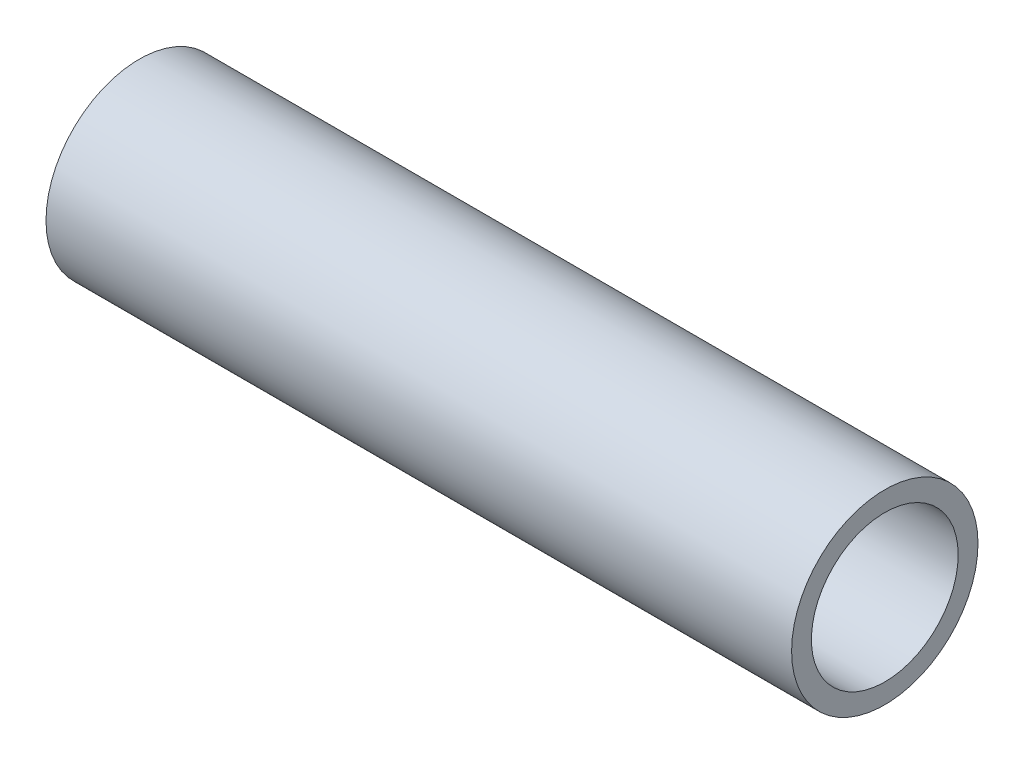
ISO-10303-21;
HEADER;
FILE_DESCRIPTION(('STEP AP214'),'2;1');
FILE_NAME('part.step','',(''),(''),'','','');
FILE_SCHEMA(('AUTOMOTIVE_DESIGN { 1 0 10303 214 1 1 1 1 }'));
ENDSEC;
DATA;
#1=APPLICATION_CONTEXT('core data for automotive mechanical design processes');
#2=APPLICATION_PROTOCOL_DEFINITION('international standard','automotive_design',2000,#1);
#3=PRODUCT_CONTEXT('',#1,'mechanical');
#4=PRODUCT('Part','Part','',(#3));
#5=PRODUCT_RELATED_PRODUCT_CATEGORY('part','',(#4));
#6=PRODUCT_DEFINITION_FORMATION('','',#4);
#7=PRODUCT_DEFINITION_CONTEXT('part definition',#1,'design');
#8=PRODUCT_DEFINITION('design','',#6,#7);
#9=PRODUCT_DEFINITION_SHAPE('','',#8);
#10=(LENGTH_UNIT() NAMED_UNIT(*) SI_UNIT(.MILLI.,.METRE.));
#11=(NAMED_UNIT(*) PLANE_ANGLE_UNIT() SI_UNIT($,.RADIAN.));
#12=(NAMED_UNIT(*) SI_UNIT($,.STERADIAN.) SOLID_ANGLE_UNIT());
#13=UNCERTAINTY_MEASURE_WITH_UNIT(LENGTH_MEASURE(1.E-05),#10,'distance_accuracy_value','');
#14=(GEOMETRIC_REPRESENTATION_CONTEXT(3) GLOBAL_UNCERTAINTY_ASSIGNED_CONTEXT((#13)) GLOBAL_UNIT_ASSIGNED_CONTEXT((#10,
#11,#12)) REPRESENTATION_CONTEXT('',''));
#15=CARTESIAN_POINT('',(0.,0.,0.));
#16=DIRECTION('',(0.,0.,1.));
#17=DIRECTION('',(1.,0.,0.));
#18=AXIS2_PLACEMENT_3D('',#15,#16,#17);
#19=CARTESIAN_POINT('',(25.4,0.,0.));
#20=DIRECTION('',(1.,0.,0.));
#21=DIRECTION('',(0.,0.,-1.));
#22=AXIS2_PLACEMENT_3D('',#19,#20,#21);
#23=PLANE('',#22);
#24=CARTESIAN_POINT('',(25.4,0.,0.));
#25=DIRECTION('',(1.,0.,0.));
#26=DIRECTION('',(0.,0.,-1.));
#27=AXIS2_PLACEMENT_3D('',#24,#25,#26);
#28=CIRCLE('',#27,6.35);
#29=CARTESIAN_POINT('',(25.4,0.,-6.35));
#30=VERTEX_POINT('',#29);
#31=EDGE_CURVE('E10',#30,#30,#28,.T.);
#32=ORIENTED_EDGE('',*,*,#31,.T.);
#33=EDGE_LOOP('',(#32));
#34=FACE_BOUND('',#33,.T.);
#35=CARTESIAN_POINT('',(25.4,0.,0.));
#36=DIRECTION('',(1.,0.,0.));
#37=DIRECTION('',(0.,0.,-1.));
#38=AXIS2_PLACEMENT_3D('',#35,#36,#37);
#39=CIRCLE('',#38,5.);
#40=CARTESIAN_POINT('',(25.4,0.,-5.));
#41=VERTEX_POINT('',#40);
#42=EDGE_CURVE('E41',#41,#41,#39,.T.);
#43=ORIENTED_EDGE('',*,*,#42,.F.);
#44=EDGE_LOOP('',(#43));
#45=FACE_BOUND('',#44,.T.);
#46=ADVANCED_FACE('F30',(#34,#45),#23,.T.);
#47=CARTESIAN_POINT('',(-25.4,0.,0.));
#48=DIRECTION('',(1.,0.,0.));
#49=DIRECTION('',(0.,0.,-1.));
#50=AXIS2_PLACEMENT_3D('',#47,#48,#49);
#51=PLANE('',#50);
#52=CARTESIAN_POINT('',(-25.4,0.,0.));
#53=DIRECTION('',(1.,0.,0.));
#54=DIRECTION('',(0.,0.,-1.));
#55=AXIS2_PLACEMENT_3D('',#52,#53,#54);
#56=CIRCLE('',#55,6.35);
#57=CARTESIAN_POINT('',(-25.4,0.,-6.35));
#58=VERTEX_POINT('',#57);
#59=EDGE_CURVE('E34',#58,#58,#56,.T.);
#60=ORIENTED_EDGE('',*,*,#59,.F.);
#61=EDGE_LOOP('',(#60));
#62=FACE_BOUND('',#61,.T.);
#63=CARTESIAN_POINT('',(-25.4,0.,0.));
#64=DIRECTION('',(1.,0.,0.));
#65=DIRECTION('',(0.,0.,-1.));
#66=AXIS2_PLACEMENT_3D('',#63,#64,#65);
#67=CIRCLE('',#66,5.);
#68=CARTESIAN_POINT('',(-25.4,0.,-5.));
#69=VERTEX_POINT('',#68);
#70=EDGE_CURVE('E43',#69,#69,#67,.T.);
#71=ORIENTED_EDGE('',*,*,#70,.T.);
#72=EDGE_LOOP('',(#71));
#73=FACE_BOUND('',#72,.T.);
#74=ADVANCED_FACE('F53',(#62,#73),#51,.F.);
#75=CARTESIAN_POINT('',(25.4,0.,0.));
#76=DIRECTION('',(-1.,0.,0.));
#77=DIRECTION('',(0.,0.,1.));
#78=AXIS2_PLACEMENT_3D('',#75,#76,#77);
#79=CYLINDRICAL_SURFACE('',#78,6.35);
#80=ORIENTED_EDGE('',*,*,#31,.F.);
#81=EDGE_LOOP('',(#80));
#82=FACE_BOUND('',#81,.T.);
#83=ORIENTED_EDGE('',*,*,#59,.T.);
#84=EDGE_LOOP('',(#83));
#85=FACE_BOUND('',#84,.T.);
#86=ADVANCED_FACE('F32',(#82,#85),#79,.T.);
#87=CARTESIAN_POINT('',(25.4,0.,0.));
#88=DIRECTION('',(-1.,0.,0.));
#89=DIRECTION('',(0.,0.,1.));
#90=AXIS2_PLACEMENT_3D('',#87,#88,#89);
#91=CYLINDRICAL_SURFACE('',#90,5.);
#92=ORIENTED_EDGE('',*,*,#42,.T.);
#93=EDGE_LOOP('',(#92));
#94=FACE_BOUND('',#93,.T.);
#95=ORIENTED_EDGE('',*,*,#70,.F.);
#96=EDGE_LOOP('',(#95));
#97=FACE_BOUND('',#96,.T.);
#98=ADVANCED_FACE('F49',(#94,#97),#91,.F.);
#99=CLOSED_SHELL('',(#46,#74,#86,#98));
#100=MANIFOLD_SOLID_BREP('B2',#99);
#101=ADVANCED_BREP_SHAPE_REPRESENTATION('',(#18,#100),#14);
#102=SHAPE_DEFINITION_REPRESENTATION(#9,#101);
ENDSEC;
END-ISO-10303-21;
